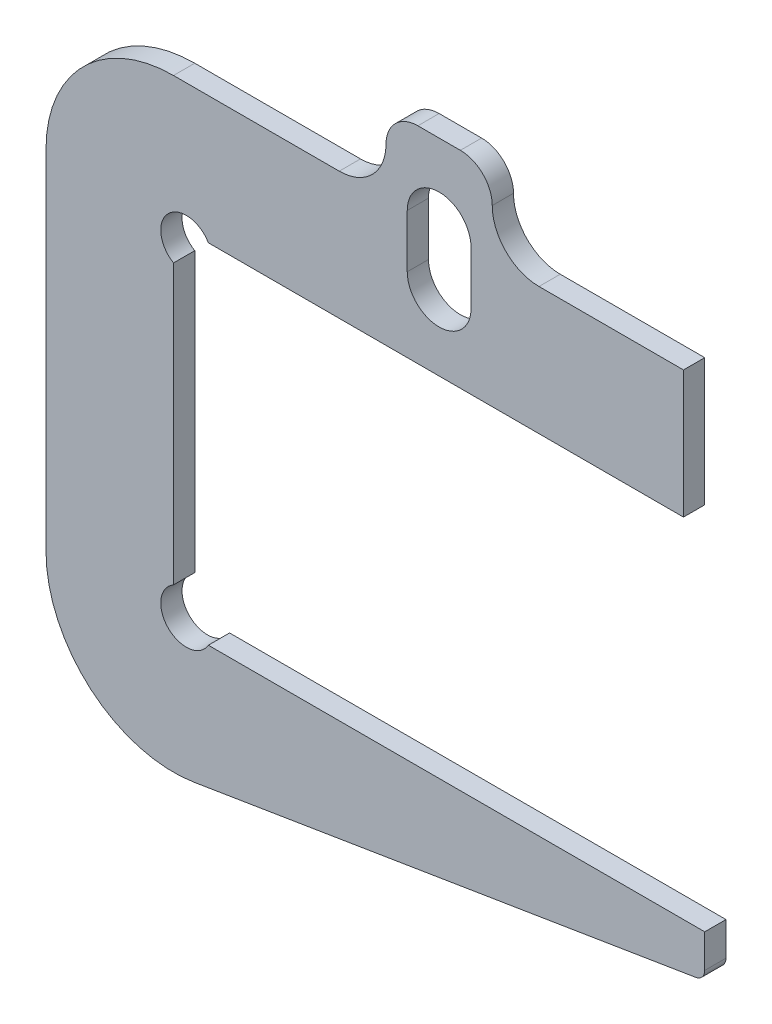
from build123d import *

# Parameters (mm, degrees)
BOSS_EXTRU_1_DEPTH = 25


with BuildPart() as part:
    # Esquisse1 → Boss.-Extru.1 (new, symmetric)
    with BuildSketch(Plane.XY):
        with BuildLine():
            Line((575, -300), (-543.038475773, -300))
            ThreePointArc((-543.038475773, -300), (-637.426406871, -287.573593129), (-625, -381.961524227))
            Line((-625, -381.961524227), (-625, -1038.038475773))
            ThreePointArc((-625, -1038.038475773), (-637.426406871, -1132.426406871), (-543.038475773, -1120))
            Line((-543.038475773, -1120), (625, -1120))
            Line((625, -1120), (625, -1198.748716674))
            ThreePointArc((625, -1198.748716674), (619.048000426, -1214.940494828), (604.026105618, -1223.422396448))
            Line((604.026105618, -1223.422396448), (-576.686732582, -1416.084157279))
            ThreePointArc((-576.686732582, -1416.084157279), (-819.301337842, -1348.576005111), (-925, -1120))
            Line((-925, -1120), (-925, -300))
            ThreePointArc((-925, -300), (-837.132034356, -87.867965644), (-625, 0))
            Line((-625, 0), (-235, 0))
            ThreePointArc((-235, 0), (-157.218254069, 32.218254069), (-125, 110))
            ThreePointArc((-125, 110), (-103.033008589, 163.033008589), (-50, 185))
            Line((-50, 185), (50, 185))
            ThreePointArc((50, 185), (103.033008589, 163.033008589), (125, 110))
            ThreePointArc((125, 110), (157.218254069, 32.218254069), (235, 0))
            Line((235, 0), (575, 0))
            Line((575, 0), (575, -300))
        make_face()
        with BuildLine():
            Line((-75, 0), (-75, -125))
            ThreePointArc((-75, -125), (0, -200), (75, -125))
            Line((75, -125), (75, 0))
            ThreePointArc((75, 0), (0, 75), (-75, 0))
        make_face(mode=Mode.SUBTRACT)
    extrude(amount=BOSS_EXTRU_1_DEPTH, both=True)


solid = part.part
